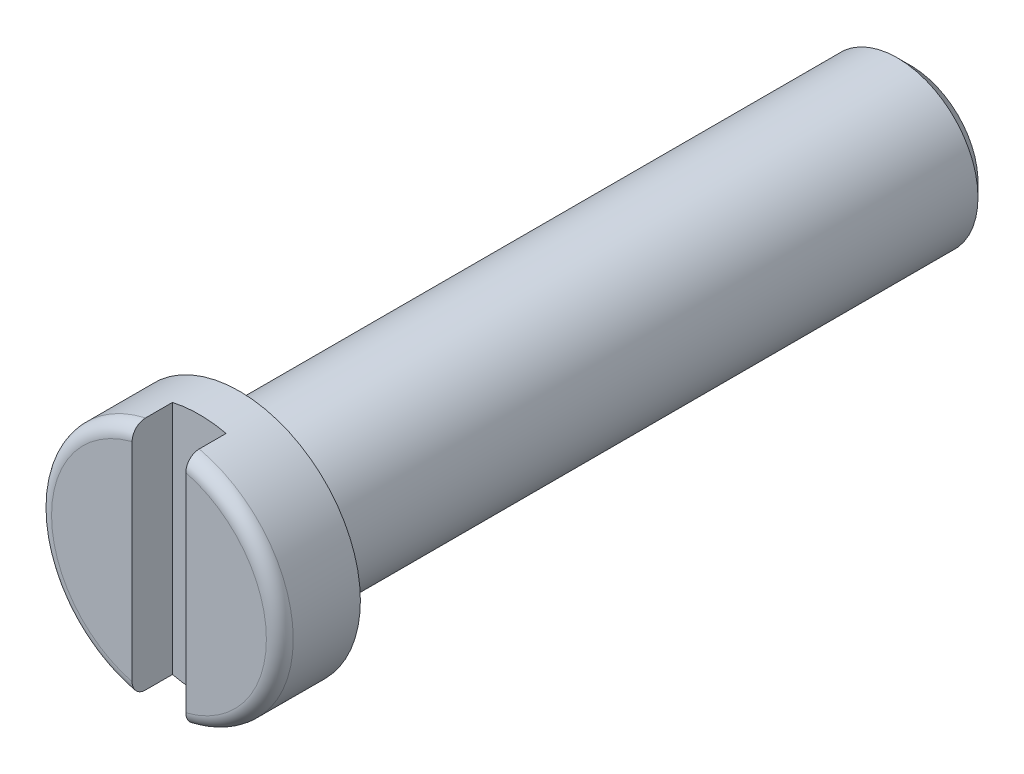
from build123d import *

# Parameters (mm, degrees)
ESQUISSE1_R             = 4.5
BOSS_EXTRU_1_DEPTH      = 3
ESQUISSE2_R             = 3
ESQUISSE2_R_2           = 2
BOSS_EXTRU_2_DEPTH      = 25
CHANFREIN1_SIZE         = 0.5
CONG_1_R                = 0.5
ESQUISSE3_W             = 2
ESQUISSE3_H             = 9.939239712
ENL_V_MAT_EXTRU_1_DEPTH = 1.5


with BuildPart() as part:
    # Esquisse1 → Boss.-Extru.1 (new body)
    with BuildSketch(Plane.XY):
        Circle(ESQUISSE1_R)
    extrude(amount=BOSS_EXTRU_1_DEPTH)

    # Esquisse2 → Boss.-Extru.2 (add)
    with BuildSketch(Plane(origin=(0, 0, 0), x_dir=(-1, 0, 0), z_dir=(0, 0, -1))):
        with Locations(Location((0, 0, 0), (0, 0, 180))):
            Circle(ESQUISSE2_R)
        Circle(ESQUISSE2_R_2, mode=Mode.SUBTRACT)
    extrude(amount=BOSS_EXTRU_2_DEPTH)

    # Chanfrein1
    chanfrein1_edges = [part.edges().sort_by_distance(p)[0] for p in [
        (-3, 0, -25),
    ]]
    chamfer(chanfrein1_edges, length=CHANFREIN1_SIZE)

    # Cong_1
    cong_1_edges = [part.edges().sort_by_distance(p)[0] for p in [
        (-4.5, 0, 3),
    ]]
    fillet(cong_1_edges, radius=CONG_1_R)

    # Esquisse3 → Enl_v. mat.-Extru.1 (cut)
    with BuildSketch(Plane.XY.offset(3)):
        with Locations((0, -0.124950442)):
            Rectangle(ESQUISSE3_W, ESQUISSE3_H)
    extrude(amount=-ENL_V_MAT_EXTRU_1_DEPTH, mode=Mode.SUBTRACT)


solid = part.part
